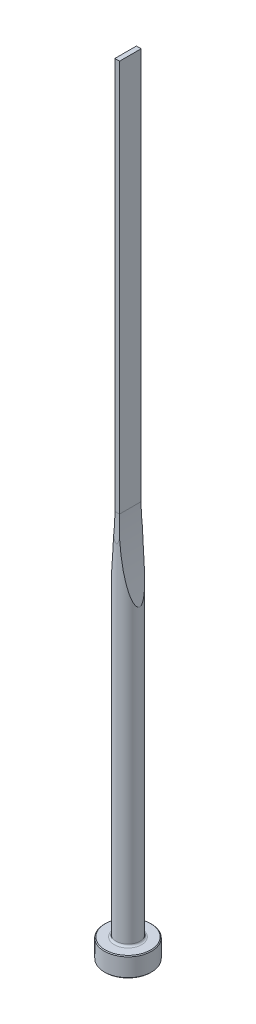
from build123d import *

# Parameters (mm, degrees)
CUT_EXTRUDE1_DEPTH = 5
CUT_EXTRUDE2_DEPTH = 5


with BuildPart() as part:
    # Sketch1 → Revolve1 (revolve)
    with BuildSketch(Plane.XY, mode=Mode.PRIVATE) as revolve1_sk:
        with BuildLine():
            Line((0, 0), (5.8, 0))
            Line((5.8, 0), (6, 0.2))
            Line((6, 0.2), (6, 4.8))
            Line((6, 4.8), (5.8, 5))
            Line((5.8, 5), (3.5, 5))
            ThreePointArc((3.5, 5), (3.146446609, 5.146446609), (3, 5.5))
            Line((3, 5.5), (3, 200))
            Line((3, 200), (0, 200))
            Line((0, 200), (0, 0))
        make_face()
    revolve(revolve1_sk.sketch.rotate(Axis((0, 200, 0), (0, -1, 0)), 180), axis=Axis((0, 200, 0), (0, -1, 0)))

    # Sketch2 → Cut-Extrude1 (cut, symmetric)
    with BuildSketch(Plane.XY):
        with BuildLine():
            Line((0.6, 200), (0.6, 100))
            ThreePointArc((0.6, 100), (1.202013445, 89.607695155), (3, 79.354419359))
            Line((3, 79.354419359), (3, 200))
            Line((3, 200), (0.6, 200))
        make_face()
        with BuildLine():
            Line((-0.6, 200), (-0.6, 100))
            ThreePointArc((-0.6, 100), (-1.202013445, 89.607695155), (-3, 79.354419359))
            Line((-3, 79.354419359), (-3, 200))
            Line((-3, 200), (-0.6, 200))
        make_face()
    extrude(amount=CUT_EXTRUDE1_DEPTH, both=True, mode=Mode.SUBTRACT)

    # Sketch3 → Cut-Extrude2 (cut, symmetric)
    with BuildSketch(Plane(origin=(0, 0, 0), x_dir=(0, 0, -1), z_dir=(1, 0, 0))):
        with BuildLine():
            Line((2.75, 200), (2.75, 100))
            ThreePointArc((2.75, 100), (2.812521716, 96.645898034), (3, 93.296456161))
            Line((3, 93.296456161), (3, 200))
            Line((3, 200), (2.75, 200))
        make_face()
        with BuildLine():
            Line((-2.75, 200), (-2.75, 100))
            ThreePointArc((-2.75, 100), (-2.812521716, 96.645898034), (-3, 93.296456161))
            Line((-3, 93.296456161), (-3, 200))
            Line((-3, 200), (-2.75, 200))
        make_face()
    extrude(amount=CUT_EXTRUDE2_DEPTH, both=True, mode=Mode.SUBTRACT)


solid = part.part
